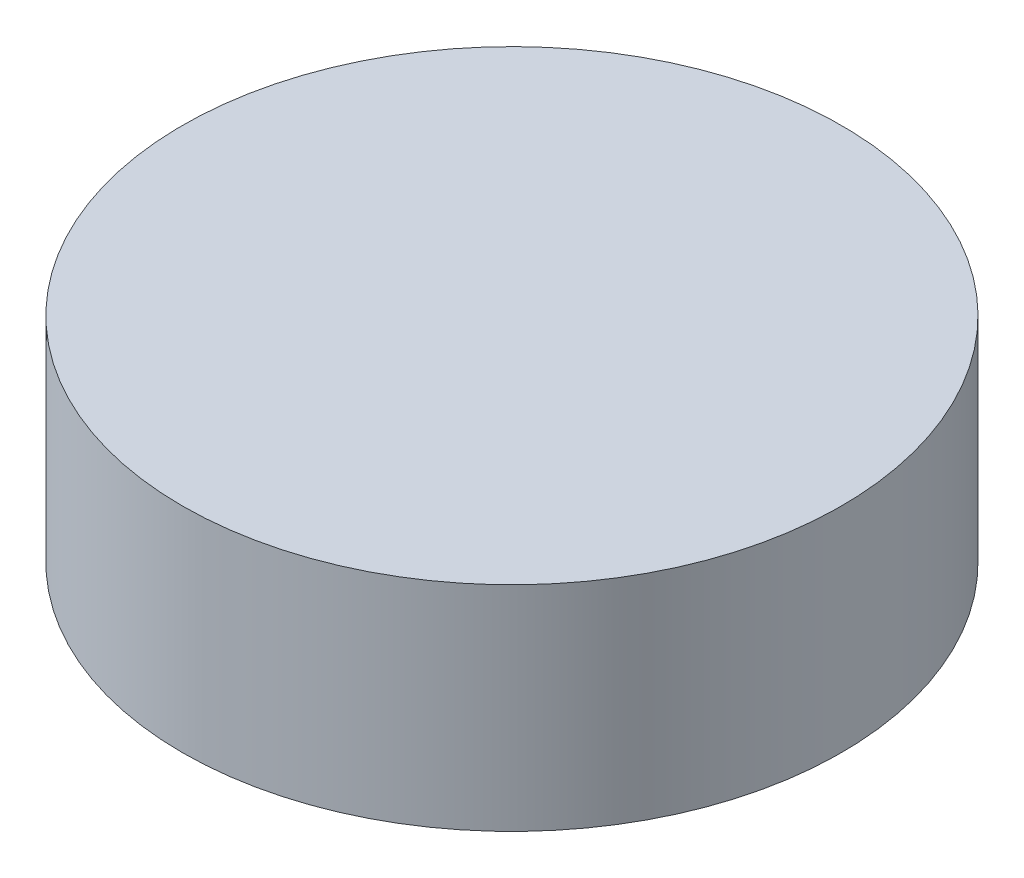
ISO-10303-21;
HEADER;
FILE_DESCRIPTION(('STEP AP214'),'2;1');
FILE_NAME('part.step','',(''),(''),'','','');
FILE_SCHEMA(('AUTOMOTIVE_DESIGN { 1 0 10303 214 1 1 1 1 }'));
ENDSEC;
DATA;
#1=APPLICATION_CONTEXT('core data for automotive mechanical design processes');
#2=APPLICATION_PROTOCOL_DEFINITION('international standard','automotive_design',2000,#1);
#3=PRODUCT_CONTEXT('',#1,'mechanical');
#4=PRODUCT('Part','Part','',(#3));
#5=PRODUCT_RELATED_PRODUCT_CATEGORY('part','',(#4));
#6=PRODUCT_DEFINITION_FORMATION('','',#4);
#7=PRODUCT_DEFINITION_CONTEXT('part definition',#1,'design');
#8=PRODUCT_DEFINITION('design','',#6,#7);
#9=PRODUCT_DEFINITION_SHAPE('','',#8);
#10=(LENGTH_UNIT() NAMED_UNIT(*) SI_UNIT(.MILLI.,.METRE.));
#11=(NAMED_UNIT(*) PLANE_ANGLE_UNIT() SI_UNIT($,.RADIAN.));
#12=(NAMED_UNIT(*) SI_UNIT($,.STERADIAN.) SOLID_ANGLE_UNIT());
#13=UNCERTAINTY_MEASURE_WITH_UNIT(LENGTH_MEASURE(1.E-05),#10,'distance_accuracy_value','');
#14=(GEOMETRIC_REPRESENTATION_CONTEXT(3) GLOBAL_UNCERTAINTY_ASSIGNED_CONTEXT((#13)) GLOBAL_UNIT_ASSIGNED_CONTEXT((#10,
#11,#12)) REPRESENTATION_CONTEXT('',''));
#15=CARTESIAN_POINT('',(0.,0.,0.));
#16=DIRECTION('',(0.,0.,1.));
#17=DIRECTION('',(1.,0.,0.));
#18=AXIS2_PLACEMENT_3D('',#15,#16,#17);
#19=CARTESIAN_POINT('',(0.,50.8,0.));
#20=DIRECTION('',(0.,-1.,0.));
#21=DIRECTION('',(0.,0.,-1.));
#22=AXIS2_PLACEMENT_3D('',#19,#20,#21);
#23=CYLINDRICAL_SURFACE('',#22,78.3645950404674);
#24=CARTESIAN_POINT('',(0.,50.8,0.));
#25=DIRECTION('',(0.,1.,0.));
#26=DIRECTION('',(0.,0.,1.));
#27=AXIS2_PLACEMENT_3D('',#24,#25,#26);
#28=CIRCLE('',#27,78.3645950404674);
#29=CARTESIAN_POINT('',(0.,50.8,78.3645950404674));
#30=VERTEX_POINT('',#29);
#31=EDGE_CURVE('E10',#30,#30,#28,.T.);
#32=ORIENTED_EDGE('',*,*,#31,.F.);
#33=EDGE_LOOP('',(#32));
#34=FACE_BOUND('',#33,.T.);
#35=CARTESIAN_POINT('',(0.,0.,0.));
#36=DIRECTION('',(0.,1.,0.));
#37=DIRECTION('',(0.,0.,1.));
#38=AXIS2_PLACEMENT_3D('',#35,#36,#37);
#39=CIRCLE('',#38,78.3645950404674);
#40=CARTESIAN_POINT('',(0.,0.,78.3645950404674));
#41=VERTEX_POINT('',#40);
#42=EDGE_CURVE('E32',#41,#41,#39,.T.);
#43=ORIENTED_EDGE('',*,*,#42,.T.);
#44=EDGE_LOOP('',(#43));
#45=FACE_BOUND('',#44,.T.);
#46=ADVANCED_FACE('F29',(#34,#45),#23,.T.);
#47=CARTESIAN_POINT('',(0.,50.8,0.));
#48=DIRECTION('',(0.,1.,0.));
#49=DIRECTION('',(0.,0.,1.));
#50=AXIS2_PLACEMENT_3D('',#47,#48,#49);
#51=PLANE('',#50);
#52=ORIENTED_EDGE('',*,*,#31,.T.);
#53=EDGE_LOOP('',(#52));
#54=FACE_BOUND('',#53,.T.);
#55=ADVANCED_FACE('F44',(#54),#51,.T.);
#56=CARTESIAN_POINT('',(0.,0.,0.));
#57=DIRECTION('',(0.,1.,0.));
#58=DIRECTION('',(0.,0.,1.));
#59=AXIS2_PLACEMENT_3D('',#56,#57,#58);
#60=PLANE('',#59);
#61=ORIENTED_EDGE('',*,*,#42,.F.);
#62=EDGE_LOOP('',(#61));
#63=FACE_BOUND('',#62,.T.);
#64=ADVANCED_FACE('F42',(#63),#60,.F.);
#65=CLOSED_SHELL('',(#46,#55,#64));
#66=MANIFOLD_SOLID_BREP('B2',#65);
#67=ADVANCED_BREP_SHAPE_REPRESENTATION('',(#18,#66),#14);
#68=SHAPE_DEFINITION_REPRESENTATION(#9,#67);
ENDSEC;
END-ISO-10303-21;
